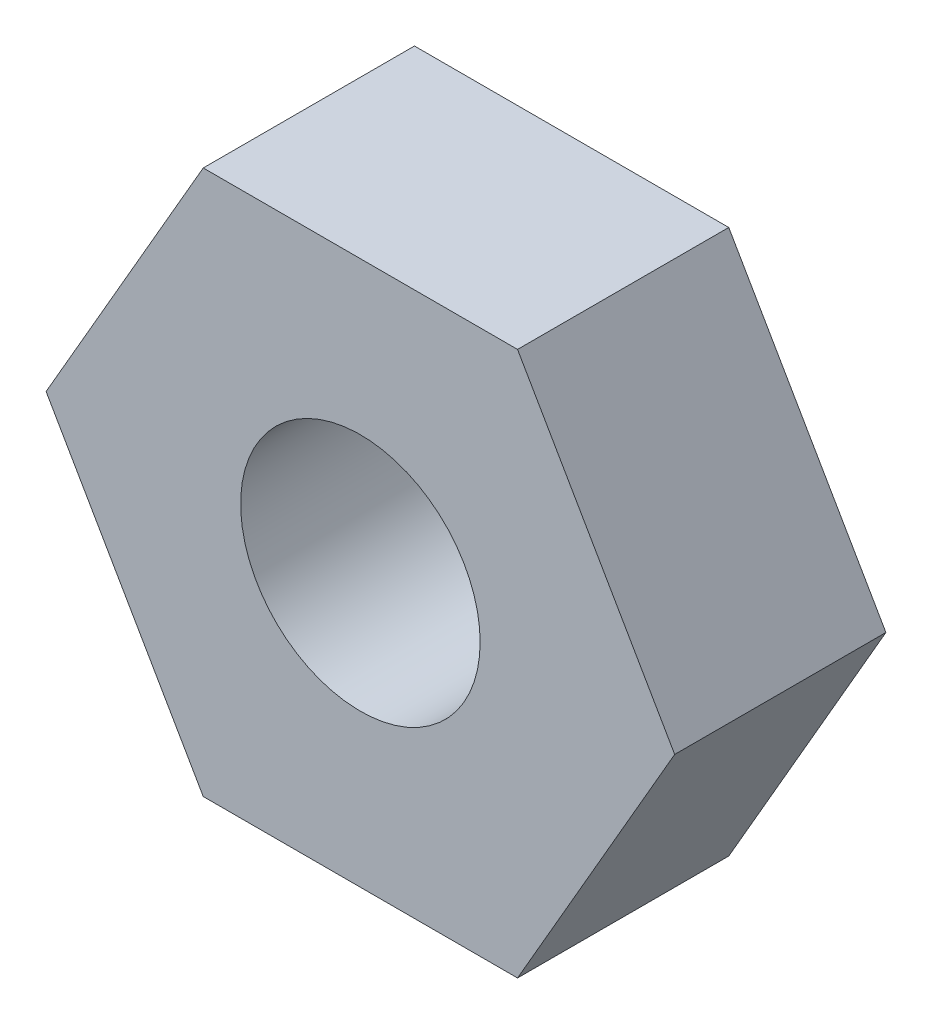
ISO-10303-21;
HEADER;
FILE_DESCRIPTION(('STEP AP214'),'2;1');
FILE_NAME('part.step','',(''),(''),'','','');
FILE_SCHEMA(('AUTOMOTIVE_DESIGN { 1 0 10303 214 1 1 1 1 }'));
ENDSEC;
DATA;
#1=APPLICATION_CONTEXT('core data for automotive mechanical design processes');
#2=APPLICATION_PROTOCOL_DEFINITION('international standard','automotive_design',2000,#1);
#3=PRODUCT_CONTEXT('',#1,'mechanical');
#4=PRODUCT('Part','Part','',(#3));
#5=PRODUCT_RELATED_PRODUCT_CATEGORY('part','',(#4));
#6=PRODUCT_DEFINITION_FORMATION('','',#4);
#7=PRODUCT_DEFINITION_CONTEXT('part definition',#1,'design');
#8=PRODUCT_DEFINITION('design','',#6,#7);
#9=PRODUCT_DEFINITION_SHAPE('','',#8);
#10=(LENGTH_UNIT() NAMED_UNIT(*) SI_UNIT(.MILLI.,.METRE.));
#11=(NAMED_UNIT(*) PLANE_ANGLE_UNIT() SI_UNIT($,.RADIAN.));
#12=(NAMED_UNIT(*) SI_UNIT($,.STERADIAN.) SOLID_ANGLE_UNIT());
#13=UNCERTAINTY_MEASURE_WITH_UNIT(LENGTH_MEASURE(1.E-05),#10,'distance_accuracy_value','');
#14=(GEOMETRIC_REPRESENTATION_CONTEXT(3) GLOBAL_UNCERTAINTY_ASSIGNED_CONTEXT((#13)) GLOBAL_UNIT_ASSIGNED_CONTEXT((#10,
#11,#12)) REPRESENTATION_CONTEXT('',''));
#15=CARTESIAN_POINT('',(0.,0.,0.));
#16=DIRECTION('',(0.,0.,1.));
#17=DIRECTION('',(1.,0.,0.));
#18=AXIS2_PLACEMENT_3D('',#15,#16,#17);
#19=CARTESIAN_POINT('',(1.8330871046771,-3.17499999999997,2.4638));
#20=DIRECTION('',(-0.866025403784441,0.499999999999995,0.));
#21=DIRECTION('',(-0.499999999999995,-0.866025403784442,0.));
#22=AXIS2_PLACEMENT_3D('',#19,#20,#21);
#23=PLANE('',#22);
#24=DIRECTION('',(0.499999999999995,0.866025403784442,0.));
#25=VECTOR('',#24,1.);
#26=CARTESIAN_POINT('',(1.8330871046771,-3.17499999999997,0.));
#27=LINE('',#26,#25);
#28=CARTESIAN_POINT('',(1.8330871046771,-3.17499999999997,0.));
#29=VERTEX_POINT('',#28);
#30=CARTESIAN_POINT('',(3.66617420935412,0.,0.));
#31=VERTEX_POINT('',#30);
#32=EDGE_CURVE('E116',#29,#31,#27,.T.);
#33=ORIENTED_EDGE('',*,*,#32,.T.);
#34=DIRECTION('',(0.,0.,-1.));
#35=VECTOR('',#34,1.);
#36=CARTESIAN_POINT('',(3.66617420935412,0.,2.4638));
#37=LINE('',#36,#35);
#38=CARTESIAN_POINT('',(3.66617420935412,0.,2.4638));
#39=VERTEX_POINT('',#38);
#40=EDGE_CURVE('E11',#39,#31,#37,.T.);
#41=ORIENTED_EDGE('',*,*,#40,.F.);
#42=DIRECTION('',(0.499999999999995,0.866025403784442,0.));
#43=VECTOR('',#42,1.);
#44=CARTESIAN_POINT('',(1.8330871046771,-3.17499999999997,2.4638));
#45=LINE('',#44,#43);
#46=CARTESIAN_POINT('',(1.8330871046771,-3.17499999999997,2.4638));
#47=VERTEX_POINT('',#46);
#48=EDGE_CURVE('E127',#47,#39,#45,.T.);
#49=ORIENTED_EDGE('',*,*,#48,.F.);
#50=DIRECTION('',(0.,0.,-1.));
#51=VECTOR('',#50,1.);
#52=CARTESIAN_POINT('',(1.8330871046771,-3.17499999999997,2.4638));
#53=LINE('',#52,#51);
#54=EDGE_CURVE('E112',#47,#29,#53,.T.);
#55=ORIENTED_EDGE('',*,*,#54,.T.);
#56=EDGE_LOOP('',(#33,#41,#49,#55));
#57=FACE_BOUND('',#56,.T.);
#58=ADVANCED_FACE('F32',(#57),#23,.F.);
#59=CARTESIAN_POINT('',(3.66617420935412,0.,2.4638));
#60=DIRECTION('',(-0.866025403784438,-0.500000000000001,0.));
#61=DIRECTION('',(0.500000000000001,-0.866025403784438,0.));
#62=AXIS2_PLACEMENT_3D('',#59,#60,#61);
#63=PLANE('',#62);
#64=DIRECTION('',(-0.500000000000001,0.866025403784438,0.));
#65=VECTOR('',#64,1.);
#66=CARTESIAN_POINT('',(3.66617420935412,0.,0.));
#67=LINE('',#66,#65);
#68=CARTESIAN_POINT('',(1.83308710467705,3.175,0.));
#69=VERTEX_POINT('',#68);
#70=EDGE_CURVE('E119',#31,#69,#67,.T.);
#71=ORIENTED_EDGE('',*,*,#70,.T.);
#72=DIRECTION('',(0.,0.,-1.));
#73=VECTOR('',#72,1.);
#74=CARTESIAN_POINT('',(1.83308710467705,3.175,2.4638));
#75=LINE('',#74,#73);
#76=CARTESIAN_POINT('',(1.83308710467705,3.175,2.4638));
#77=VERTEX_POINT('',#76);
#78=EDGE_CURVE('E40',#77,#69,#75,.T.);
#79=ORIENTED_EDGE('',*,*,#78,.F.);
#80=DIRECTION('',(-0.500000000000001,0.866025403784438,0.));
#81=VECTOR('',#80,1.);
#82=CARTESIAN_POINT('',(3.66617420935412,0.,2.4638));
#83=LINE('',#82,#81);
#84=EDGE_CURVE('E85',#39,#77,#83,.T.);
#85=ORIENTED_EDGE('',*,*,#84,.F.);
#86=ORIENTED_EDGE('',*,*,#40,.T.);
#87=EDGE_LOOP('',(#71,#79,#85,#86));
#88=FACE_BOUND('',#87,.T.);
#89=ADVANCED_FACE('F152',(#88),#63,.F.);
#90=CARTESIAN_POINT('',(1.83308710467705,3.175,2.4638));
#91=DIRECTION('',(0.,-1.,0.));
#92=DIRECTION('',(1.,0.,0.));
#93=AXIS2_PLACEMENT_3D('',#90,#91,#92);
#94=PLANE('',#93);
#95=DIRECTION('',(-1.,0.,0.));
#96=VECTOR('',#95,1.);
#97=CARTESIAN_POINT('',(1.83308710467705,3.175,0.));
#98=LINE('',#97,#96);
#99=CARTESIAN_POINT('',(-1.83308710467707,3.17499999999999,0.));
#100=VERTEX_POINT('',#99);
#101=EDGE_CURVE('E122',#69,#100,#98,.T.);
#102=ORIENTED_EDGE('',*,*,#101,.T.);
#103=DIRECTION('',(0.,0.,-1.));
#104=VECTOR('',#103,1.);
#105=CARTESIAN_POINT('',(-1.83308710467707,3.17499999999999,2.4638));
#106=LINE('',#105,#104);
#107=CARTESIAN_POINT('',(-1.83308710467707,3.17499999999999,2.4638));
#108=VERTEX_POINT('',#107);
#109=EDGE_CURVE('E107',#108,#100,#106,.T.);
#110=ORIENTED_EDGE('',*,*,#109,.F.);
#111=DIRECTION('',(-1.,0.,0.));
#112=VECTOR('',#111,1.);
#113=CARTESIAN_POINT('',(1.83308710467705,3.175,2.4638));
#114=LINE('',#113,#112);
#115=EDGE_CURVE('E98',#77,#108,#114,.T.);
#116=ORIENTED_EDGE('',*,*,#115,.F.);
#117=ORIENTED_EDGE('',*,*,#78,.T.);
#118=EDGE_LOOP('',(#102,#110,#116,#117));
#119=FACE_BOUND('',#118,.T.);
#120=ADVANCED_FACE('F133',(#119),#94,.F.);
#121=CARTESIAN_POINT('',(-1.83308710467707,3.17499999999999,2.4638));
#122=DIRECTION('',(0.866025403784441,-0.499999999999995,0.));
#123=DIRECTION('',(0.499999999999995,0.866025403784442,0.));
#124=AXIS2_PLACEMENT_3D('',#121,#122,#123);
#125=PLANE('',#124);
#126=DIRECTION('',(-0.499999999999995,-0.866025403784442,0.));
#127=VECTOR('',#126,1.);
#128=CARTESIAN_POINT('',(-1.83308710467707,3.17499999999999,0.));
#129=LINE('',#128,#127);
#130=CARTESIAN_POINT('',(-3.66617420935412,0.,0.));
#131=VERTEX_POINT('',#130);
#132=EDGE_CURVE('E106',#100,#131,#129,.T.);
#133=ORIENTED_EDGE('',*,*,#132,.T.);
#134=DIRECTION('',(0.,0.,-1.));
#135=VECTOR('',#134,1.);
#136=CARTESIAN_POINT('',(-3.66617420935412,0.,2.4638));
#137=LINE('',#136,#135);
#138=CARTESIAN_POINT('',(-3.66617420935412,0.,2.4638));
#139=VERTEX_POINT('',#138);
#140=EDGE_CURVE('E103',#139,#131,#137,.T.);
#141=ORIENTED_EDGE('',*,*,#140,.F.);
#142=DIRECTION('',(-0.499999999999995,-0.866025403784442,0.));
#143=VECTOR('',#142,1.);
#144=CARTESIAN_POINT('',(-1.83308710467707,3.17499999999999,2.4638));
#145=LINE('',#144,#143);
#146=EDGE_CURVE('E92',#108,#139,#145,.T.);
#147=ORIENTED_EDGE('',*,*,#146,.F.);
#148=ORIENTED_EDGE('',*,*,#109,.T.);
#149=EDGE_LOOP('',(#133,#141,#147,#148));
#150=FACE_BOUND('',#149,.T.);
#151=ADVANCED_FACE('F104',(#150),#125,.F.);
#152=CARTESIAN_POINT('',(-3.66617420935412,0.,2.4638));
#153=DIRECTION('',(0.866025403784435,0.500000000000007,0.));
#154=DIRECTION('',(-0.500000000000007,0.866025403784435,0.));
#155=AXIS2_PLACEMENT_3D('',#152,#153,#154);
#156=PLANE('',#155);
#157=DIRECTION('',(0.500000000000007,-0.866025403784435,0.));
#158=VECTOR('',#157,1.);
#159=CARTESIAN_POINT('',(-3.66617420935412,0.,0.));
#160=LINE('',#159,#158);
#161=CARTESIAN_POINT('',(-1.83308710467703,-3.17500000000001,0.));
#162=VERTEX_POINT('',#161);
#163=EDGE_CURVE('E71',#131,#162,#160,.T.);
#164=ORIENTED_EDGE('',*,*,#163,.T.);
#165=DIRECTION('',(0.,0.,-1.));
#166=VECTOR('',#165,1.);
#167=CARTESIAN_POINT('',(-1.83308710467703,-3.17500000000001,2.4638));
#168=LINE('',#167,#166);
#169=CARTESIAN_POINT('',(-1.83308710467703,-3.17500000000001,2.4638));
#170=VERTEX_POINT('',#169);
#171=EDGE_CURVE('E108',#170,#162,#168,.T.);
#172=ORIENTED_EDGE('',*,*,#171,.F.);
#173=DIRECTION('',(0.500000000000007,-0.866025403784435,0.));
#174=VECTOR('',#173,1.);
#175=CARTESIAN_POINT('',(-3.66617420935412,0.,2.4638));
#176=LINE('',#175,#174);
#177=EDGE_CURVE('E96',#139,#170,#176,.T.);
#178=ORIENTED_EDGE('',*,*,#177,.F.);
#179=ORIENTED_EDGE('',*,*,#140,.T.);
#180=EDGE_LOOP('',(#164,#172,#178,#179));
#181=FACE_BOUND('',#180,.T.);
#182=ADVANCED_FACE('F110',(#181),#156,.F.);
#183=CARTESIAN_POINT('',(-1.83308710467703,-3.17500000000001,2.4638));
#184=DIRECTION('',(0.,1.,0.));
#185=DIRECTION('',(-1.,0.,0.));
#186=AXIS2_PLACEMENT_3D('',#183,#184,#185);
#187=PLANE('',#186);
#188=DIRECTION('',(1.,0.,0.));
#189=VECTOR('',#188,1.);
#190=CARTESIAN_POINT('',(-1.83308710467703,-3.17500000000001,0.));
#191=LINE('',#190,#189);
#192=EDGE_CURVE('E77',#162,#29,#191,.T.);
#193=ORIENTED_EDGE('',*,*,#192,.T.);
#194=ORIENTED_EDGE('',*,*,#54,.F.);
#195=DIRECTION('',(1.,0.,0.));
#196=VECTOR('',#195,1.);
#197=CARTESIAN_POINT('',(-1.83308710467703,-3.17500000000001,2.4638));
#198=LINE('',#197,#196);
#199=EDGE_CURVE('E48',#170,#47,#198,.T.);
#200=ORIENTED_EDGE('',*,*,#199,.F.);
#201=ORIENTED_EDGE('',*,*,#171,.T.);
#202=EDGE_LOOP('',(#193,#194,#200,#201));
#203=FACE_BOUND('',#202,.T.);
#204=ADVANCED_FACE('F140',(#203),#187,.F.);
#205=CARTESIAN_POINT('',(0.,0.,2.4638));
#206=DIRECTION('',(0.,0.,1.));
#207=DIRECTION('',(1.,0.,0.));
#208=AXIS2_PLACEMENT_3D('',#205,#206,#207);
#209=PLANE('',#208);
#210=CARTESIAN_POINT('',(0.,0.,2.4638));
#211=DIRECTION('',(0.,0.,1.));
#212=DIRECTION('',(1.,0.,0.));
#213=AXIS2_PLACEMENT_3D('',#210,#211,#212);
#214=CIRCLE('',#213,1.397);
#215=CARTESIAN_POINT('',(1.397,0.,2.4638));
#216=VERTEX_POINT('',#215);
#217=EDGE_CURVE('E207',#216,#216,#214,.T.);
#218=ORIENTED_EDGE('',*,*,#217,.F.);
#219=EDGE_LOOP('',(#218));
#220=FACE_BOUND('',#219,.T.);
#221=ORIENTED_EDGE('',*,*,#48,.T.);
#222=ORIENTED_EDGE('',*,*,#84,.T.);
#223=ORIENTED_EDGE('',*,*,#115,.T.);
#224=ORIENTED_EDGE('',*,*,#146,.T.);
#225=ORIENTED_EDGE('',*,*,#177,.T.);
#226=ORIENTED_EDGE('',*,*,#199,.T.);
#227=EDGE_LOOP('',(#221,#222,#223,#224,#225,#226));
#228=FACE_BOUND('',#227,.T.);
#229=ADVANCED_FACE('F94',(#220,#228),#209,.T.);
#230=CARTESIAN_POINT('',(0.,0.,0.));
#231=DIRECTION('',(0.,0.,1.));
#232=DIRECTION('',(1.,0.,0.));
#233=AXIS2_PLACEMENT_3D('',#230,#231,#232);
#234=PLANE('',#233);
#235=CARTESIAN_POINT('',(0.,0.,0.));
#236=DIRECTION('',(0.,0.,1.));
#237=DIRECTION('',(1.,0.,0.));
#238=AXIS2_PLACEMENT_3D('',#235,#236,#237);
#239=CIRCLE('',#238,1.397);
#240=CARTESIAN_POINT('',(1.397,0.,0.));
#241=VERTEX_POINT('',#240);
#242=EDGE_CURVE('E120',#241,#241,#239,.T.);
#243=ORIENTED_EDGE('',*,*,#242,.T.);
#244=EDGE_LOOP('',(#243));
#245=FACE_BOUND('',#244,.T.);
#246=ORIENTED_EDGE('',*,*,#32,.F.);
#247=ORIENTED_EDGE('',*,*,#192,.F.);
#248=ORIENTED_EDGE('',*,*,#163,.F.);
#249=ORIENTED_EDGE('',*,*,#132,.F.);
#250=ORIENTED_EDGE('',*,*,#101,.F.);
#251=ORIENTED_EDGE('',*,*,#70,.F.);
#252=EDGE_LOOP('',(#246,#247,#248,#249,#250,#251));
#253=FACE_BOUND('',#252,.T.);
#254=ADVANCED_FACE('F136',(#245,#253),#234,.F.);
#255=CARTESIAN_POINT('',(0.,0.,0.));
#256=DIRECTION('',(0.,0.,1.));
#257=DIRECTION('',(1.,0.,0.));
#258=AXIS2_PLACEMENT_3D('',#255,#256,#257);
#259=CYLINDRICAL_SURFACE('',#258,1.397);
#260=ORIENTED_EDGE('',*,*,#242,.F.);
#261=EDGE_LOOP('',(#260));
#262=FACE_BOUND('',#261,.T.);
#263=ORIENTED_EDGE('',*,*,#217,.T.);
#264=EDGE_LOOP('',(#263));
#265=FACE_BOUND('',#264,.T.);
#266=ADVANCED_FACE('F189',(#262,#265),#259,.F.);
#267=CLOSED_SHELL('',(#58,#89,#120,#151,#182,#204,#229,#254,#266));
#268=MANIFOLD_SOLID_BREP('B2',#267);
#269=ADVANCED_BREP_SHAPE_REPRESENTATION('',(#18,#268),#14);
#270=SHAPE_DEFINITION_REPRESENTATION(#9,#269);
ENDSEC;
END-ISO-10303-21;
